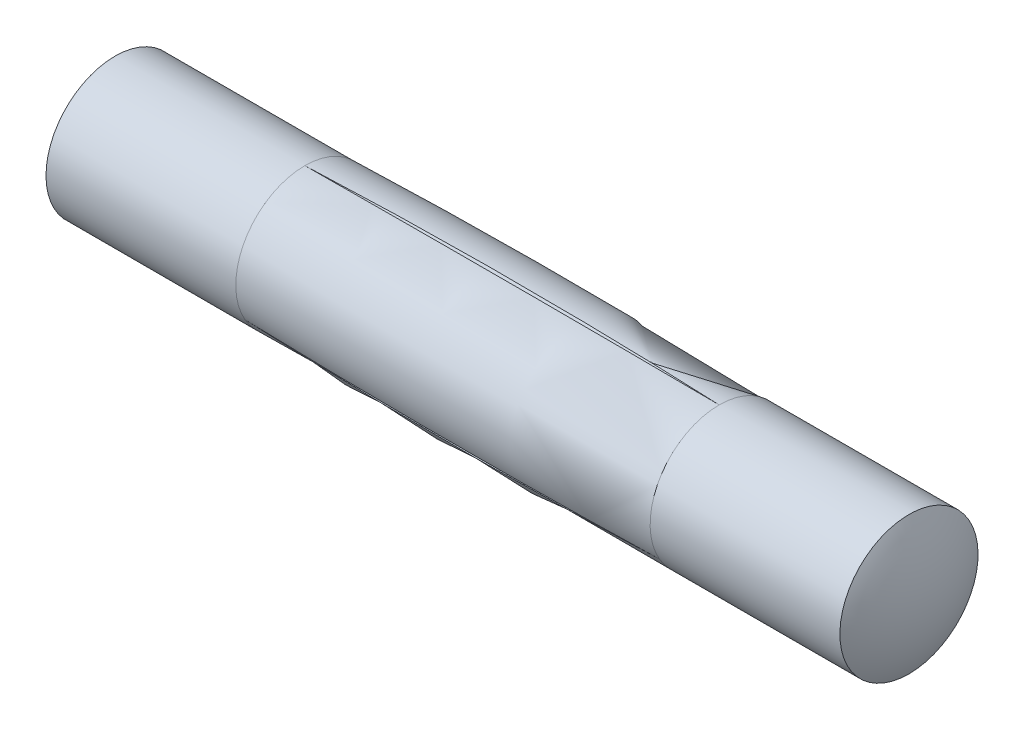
from build123d import *

# Parameters (mm, degrees)
CUT_EXTRUDE1_DEPTH = 7.5
CIRPATTERN2_COUNT  = 3


with BuildPart() as part:
    # Sketch1 → Revolve3 (revolve)
    with BuildSketch(Plane.XY, mode=Mode.PRIVATE) as revolve3_sk:
        with BuildLine():
            Line((-14.37, 2.5), (14.37, 2.5))
            ThreePointArc((14.37, 2.5), (14.840075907, 1.289079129), (15, 0))
            Line((15, 0), (-15, 0))
            ThreePointArc((-15, 0), (-14.840075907, 1.289079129), (-14.37, 2.5))
        make_face()
    revolve(revolve3_sk.sketch.rotate(Axis((-15, 0, 0), (1, 0, 0)), 180), axis=Axis((-15, 0, 0), (1, 0, 0)))

    # Sketch2 → Revolve4 (revolve)
    with BuildSketch(Plane.XY, mode=Mode.PRIVATE) as revolve4_sk:
        with BuildLine():
            Line((-7.5, 2.5), (-7.5, 0))
            Line((-7.5, 0), (7.5, 0))
            Line((7.5, 0), (7.5, 2.5))
            ThreePointArc((7.5, 2.5), (0, 2.6), (-7.5, 2.5))
        make_face()
    revolve(revolve4_sk.sketch.rotate(Axis((0, 0, 0), (1, 0, 0)), 180), axis=Axis((0, 0, 0), (1, 0, 0)))

    # Sketch3 → Cut-Extrude1 (cut, symmetric)
    with BuildSketch(Plane(origin=(0, 0, 0), x_dir=(0, 0, -1), z_dir=(1, 0, 0))):
        with BuildLine():
            Line((0, 2.5), (-0.114715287, 2.663830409))
            ThreePointArc((-0.114715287, 2.663830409), (0, 2.7), (0.114715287, 2.663830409))
            Line((0.114715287, 2.663830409), (0, 2.5))
        make_face()
    cut_extrude1 = extrude(amount=CUT_EXTRUDE1_DEPTH, both=True, mode=Mode.SUBTRACT)

    # CirPattern2: Cut-Extrude1 ×3 about axis
    cirpattern2_axis = Axis((0, 0, 0), (1, 0, 0))
    for i in range(1, CIRPATTERN2_COUNT):
        add(cut_extrude1.rotate(cirpattern2_axis, i * 360 / CIRPATTERN2_COUNT), mode=Mode.SUBTRACT)


solid = part.part
